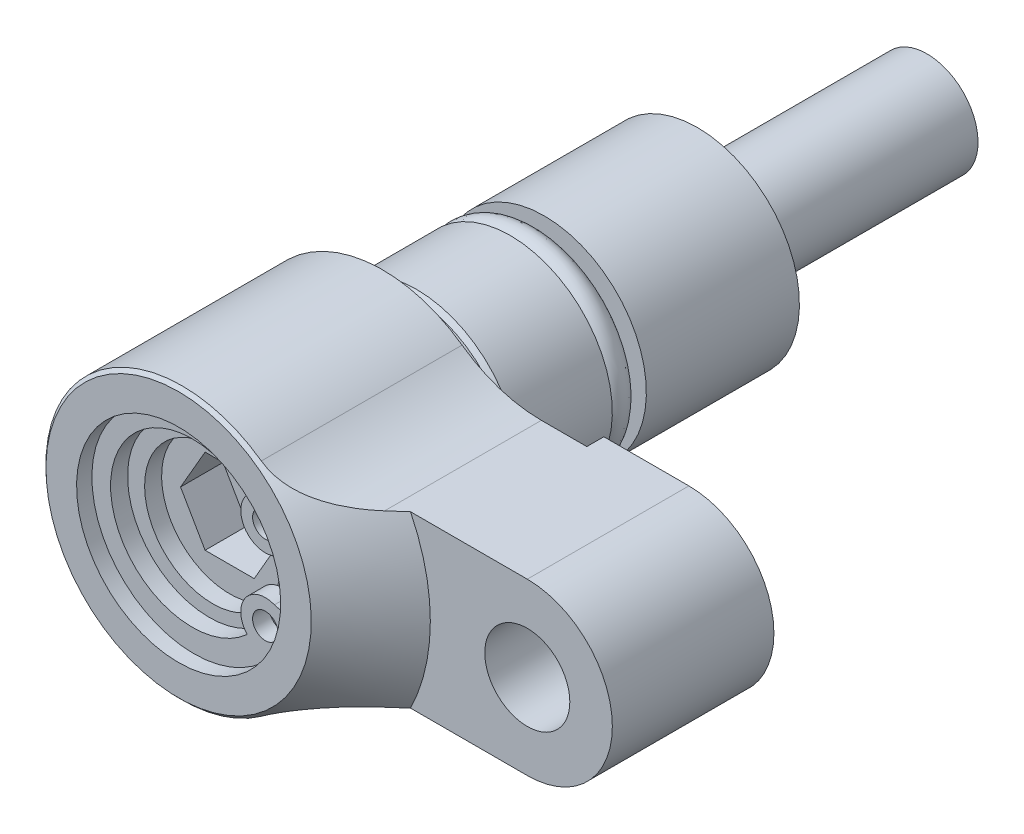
ISO-10303-21;
HEADER;
FILE_DESCRIPTION(('STEP AP214'),'2;1');
FILE_NAME('part.step','',(''),(''),'','','');
FILE_SCHEMA(('AUTOMOTIVE_DESIGN { 1 0 10303 214 1 1 1 1 }'));
ENDSEC;
DATA;
#1=APPLICATION_CONTEXT('core data for automotive mechanical design processes');
#2=APPLICATION_PROTOCOL_DEFINITION('international standard','automotive_design',2000,#1);
#3=PRODUCT_CONTEXT('',#1,'mechanical');
#4=PRODUCT('Part','Part','',(#3));
#5=PRODUCT_RELATED_PRODUCT_CATEGORY('part','',(#4));
#6=PRODUCT_DEFINITION_FORMATION('','',#4);
#7=PRODUCT_DEFINITION_CONTEXT('part definition',#1,'design');
#8=PRODUCT_DEFINITION('design','',#6,#7);
#9=PRODUCT_DEFINITION_SHAPE('','',#8);
#10=(LENGTH_UNIT() NAMED_UNIT(*) SI_UNIT(.MILLI.,.METRE.));
#11=(NAMED_UNIT(*) PLANE_ANGLE_UNIT() SI_UNIT($,.RADIAN.));
#12=(NAMED_UNIT(*) SI_UNIT($,.STERADIAN.) SOLID_ANGLE_UNIT());
#13=UNCERTAINTY_MEASURE_WITH_UNIT(LENGTH_MEASURE(1.E-05),#10,'distance_accuracy_value','');
#14=(GEOMETRIC_REPRESENTATION_CONTEXT(3) GLOBAL_UNCERTAINTY_ASSIGNED_CONTEXT((#13)) GLOBAL_UNIT_ASSIGNED_CONTEXT((#10,
#11,#12)) REPRESENTATION_CONTEXT('',''));
#15=CARTESIAN_POINT('',(0.,0.,0.));
#16=DIRECTION('',(0.,0.,1.));
#17=DIRECTION('',(1.,0.,0.));
#18=AXIS2_PLACEMENT_3D('',#15,#16,#17);
#19=CARTESIAN_POINT('',(6.072,6.072,-6.5));
#20=DIRECTION('',(0.,0.,-1.));
#21=DIRECTION('',(0.,-1.,0.));
#22=AXIS2_PLACEMENT_3D('',#19,#20,#21);
#23=PLANE('',#22);
#24=CARTESIAN_POINT('',(0.,0.,-6.5));
#25=DIRECTION('',(0.,0.,-1.));
#26=DIRECTION('',(0.,1.,0.));
#27=AXIS2_PLACEMENT_3D('',#24,#25,#26);
#28=CIRCLE('',#27,6.);
#29=CARTESIAN_POINT('',(0.,6.,-6.5));
#30=VERTEX_POINT('',#29);
#31=EDGE_CURVE('E266',#30,#30,#28,.T.);
#32=ORIENTED_EDGE('',*,*,#31,.T.);
#33=EDGE_LOOP('',(#32));
#34=FACE_BOUND('',#33,.T.);
#35=CARTESIAN_POINT('',(0.,0.,-6.5));
#36=DIRECTION('',(0.,0.,1.));
#37=DIRECTION('',(0.,-1.,0.));
#38=AXIS2_PLACEMENT_3D('',#35,#36,#37);
#39=CIRCLE('',#38,5.375);
#40=CARTESIAN_POINT('',(0.,-5.375,-6.5));
#41=VERTEX_POINT('',#40);
#42=EDGE_CURVE('E405',#41,#41,#39,.T.);
#43=ORIENTED_EDGE('',*,*,#42,.T.);
#44=EDGE_LOOP('',(#43));
#45=FACE_BOUND('',#44,.T.);
#46=ADVANCED_FACE('F14',(#34,#45),#23,.T.);
#47=CARTESIAN_POINT('',(0.,0.,11.));
#48=DIRECTION('',(0.,0.,-1.));
#49=DIRECTION('',(0.,1.,0.));
#50=AXIS2_PLACEMENT_3D('',#47,#48,#49);
#51=CYLINDRICAL_SURFACE('',#50,4.);
#52=CARTESIAN_POINT('',(0.,0.,11.));
#53=DIRECTION('',(0.,0.,-1.));
#54=DIRECTION('',(0.,1.,0.));
#55=AXIS2_PLACEMENT_3D('',#52,#53,#54);
#56=CIRCLE('',#55,4.);
#57=CARTESIAN_POINT('',(3.82683149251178,-1.16419960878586,11.));
#58=VERTEX_POINT('',#57);
#59=CARTESIAN_POINT('',(2.70178181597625,-2.94963981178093,11.));
#60=VERTEX_POINT('',#59);
#61=EDGE_CURVE('E206',#58,#60,#56,.T.);
#62=ORIENTED_EDGE('',*,*,#61,.F.);
#63=CARTESIAN_POINT('',(0.,0.,11.));
#64=DIRECTION('',(0.,0.,-1.));
#65=DIRECTION('',(0.,1.,0.));
#66=AXIS2_PLACEMENT_3D('',#63,#64,#65);
#67=CIRCLE('',#66,4.);
#68=CARTESIAN_POINT('',(3.82683149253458,1.16419960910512,11.));
#69=VERTEX_POINT('',#68);
#70=EDGE_CURVE('E214',#69,#58,#67,.T.);
#71=ORIENTED_EDGE('',*,*,#70,.F.);
#72=CARTESIAN_POINT('',(0.,0.,11.));
#73=DIRECTION('',(0.,0.,-1.));
#74=DIRECTION('',(0.,1.,0.));
#75=AXIS2_PLACEMENT_3D('',#72,#73,#74);
#76=CIRCLE('',#75,4.);
#77=CARTESIAN_POINT('',(2.7017818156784,2.94963981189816,11.));
#78=VERTEX_POINT('',#77);
#79=EDGE_CURVE('E216',#78,#69,#76,.T.);
#80=ORIENTED_EDGE('',*,*,#79,.F.);
#81=CARTESIAN_POINT('',(0.,0.,11.));
#82=DIRECTION('',(0.,0.,-1.));
#83=DIRECTION('',(0.,1.,0.));
#84=AXIS2_PLACEMENT_3D('',#81,#82,#83);
#85=CIRCLE('',#84,4.);
#86=EDGE_CURVE('E203',#60,#78,#85,.T.);
#87=ORIENTED_EDGE('',*,*,#86,.F.);
#88=EDGE_LOOP('',(#62,#71,#80,#87));
#89=FACE_BOUND('',#88,.T.);
#90=CARTESIAN_POINT('',(0.,0.,10.));
#91=DIRECTION('',(0.,0.,-1.));
#92=DIRECTION('',(0.,1.,0.));
#93=AXIS2_PLACEMENT_3D('',#90,#91,#92);
#94=CIRCLE('',#93,4.);
#95=CARTESIAN_POINT('',(0.,4.,10.));
#96=VERTEX_POINT('',#95);
#97=EDGE_CURVE('E18',#96,#96,#94,.T.);
#98=ORIENTED_EDGE('',*,*,#97,.T.);
#99=EDGE_LOOP('',(#98));
#100=FACE_BOUND('',#99,.T.);
#101=ADVANCED_FACE('F485',(#89,#100),#51,.F.);
#102=CARTESIAN_POINT('',(0.,0.,-1.));
#103=DIRECTION('',(0.,0.,-1.));
#104=DIRECTION('',(0.,1.,0.));
#105=AXIS2_PLACEMENT_3D('',#102,#103,#104);
#106=CYLINDRICAL_SURFACE('',#105,6.);
#107=CARTESIAN_POINT('',(0.,0.,-1.00000000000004));
#108=DIRECTION('',(0.,0.,-1.));
#109=DIRECTION('',(0.,-1.,0.));
#110=AXIS2_PLACEMENT_3D('',#107,#108,#109);
#111=CIRCLE('',#110,6.);
#112=CARTESIAN_POINT('',(0.,-6.,-1.));
#113=VERTEX_POINT('',#112);
#114=EDGE_CURVE('E262',#113,#113,#111,.T.);
#115=ORIENTED_EDGE('',*,*,#114,.T.);
#116=EDGE_LOOP('',(#115));
#117=FACE_BOUND('',#116,.T.);
#118=ORIENTED_EDGE('',*,*,#31,.F.);
#119=EDGE_LOOP('',(#118));
#120=FACE_BOUND('',#119,.T.);
#121=ADVANCED_FACE('F446',(#117,#120),#106,.T.);
#122=CARTESIAN_POINT('',(0.,0.,-0.75));
#123=DIRECTION('',(0.,0.,-1.));
#124=DIRECTION('',(0.,1.,0.));
#125=AXIS2_PLACEMENT_3D('',#122,#123,#124);
#126=CONICAL_SURFACE('',#125,5.75,0.785398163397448);
#127=CARTESIAN_POINT('',(0.,0.,-0.75));
#128=DIRECTION('',(0.,0.,-1.));
#129=DIRECTION('',(0.,-1.,0.));
#130=AXIS2_PLACEMENT_3D('',#127,#128,#129);
#131=CIRCLE('',#130,5.75);
#132=CARTESIAN_POINT('',(0.,-5.75,-0.75));
#133=VERTEX_POINT('',#132);
#134=EDGE_CURVE('E267',#133,#133,#131,.T.);
#135=ORIENTED_EDGE('',*,*,#134,.T.);
#136=EDGE_LOOP('',(#135));
#137=FACE_BOUND('',#136,.T.);
#138=ORIENTED_EDGE('',*,*,#114,.F.);
#139=EDGE_LOOP('',(#138));
#140=FACE_BOUND('',#139,.T.);
#141=ADVANCED_FACE('F484',(#137,#140),#126,.T.);
#142=CARTESIAN_POINT('',(22.06,-5.,0.));
#143=DIRECTION('',(0.,0.,1.));
#144=DIRECTION('',(0.,1.,0.));
#145=AXIS2_PLACEMENT_3D('',#142,#143,#144);
#146=PLANE('',#145);
#147=CARTESIAN_POINT('',(17.,0.,0.));
#148=DIRECTION('',(0.,0.,1.));
#149=DIRECTION('',(1.,0.,0.));
#150=AXIS2_PLACEMENT_3D('',#147,#148,#149);
#151=CIRCLE('',#150,2.5);
#152=CARTESIAN_POINT('',(19.5,0.,0.));
#153=VERTEX_POINT('',#152);
#154=EDGE_CURVE('E422',#153,#153,#151,.T.);
#155=ORIENTED_EDGE('',*,*,#154,.T.);
#156=EDGE_LOOP('',(#155));
#157=FACE_BOUND('',#156,.T.);
#158=DIRECTION('',(0.,1.,0.));
#159=VECTOR('',#158,1.);
#160=CARTESIAN_POINT('',(12.,0.,0.));
#161=LINE('',#160,#159);
#162=CARTESIAN_POINT('',(12.0000000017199,-5.,0.));
#163=VERTEX_POINT('',#162);
#164=CARTESIAN_POINT('',(12.0000000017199,5.,0.));
#165=VERTEX_POINT('',#164);
#166=EDGE_CURVE('E271',#163,#165,#161,.T.);
#167=ORIENTED_EDGE('',*,*,#166,.T.);
#168=DIRECTION('',(1.,0.,0.));
#169=VECTOR('',#168,1.);
#170=CARTESIAN_POINT('',(13.1636895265,5.,0.));
#171=LINE('',#170,#169);
#172=CARTESIAN_POINT('',(17.0000000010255,5.,0.));
#173=VERTEX_POINT('',#172);
#174=EDGE_CURVE('E137',#165,#173,#171,.T.);
#175=ORIENTED_EDGE('',*,*,#174,.T.);
#176=CARTESIAN_POINT('',(17.,0.,0.));
#177=DIRECTION('',(0.,0.,-1.));
#178=DIRECTION('',(1.,0.,0.));
#179=AXIS2_PLACEMENT_3D('',#176,#177,#178);
#180=CIRCLE('',#179,5.);
#181=CARTESIAN_POINT('',(17.,-5.,0.));
#182=VERTEX_POINT('',#181);
#183=EDGE_CURVE('E136',#173,#182,#180,.T.);
#184=ORIENTED_EDGE('',*,*,#183,.T.);
#185=DIRECTION('',(-1.,0.,0.));
#186=VECTOR('',#185,1.);
#187=CARTESIAN_POINT('',(13.1636895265,-5.,0.));
#188=LINE('',#187,#186);
#189=EDGE_CURVE('E283',#182,#163,#188,.T.);
#190=ORIENTED_EDGE('',*,*,#189,.T.);
#191=EDGE_LOOP('',(#167,#175,#184,#190));
#192=FACE_BOUND('',#191,.T.);
#193=ADVANCED_FACE('F495',(#157,#192),#146,.F.);
#194=CARTESIAN_POINT('',(12.,-5.,0.));
#195=DIRECTION('',(1.,0.,0.));
#196=DIRECTION('',(0.,1.,0.));
#197=AXIS2_PLACEMENT_3D('',#194,#195,#196);
#198=PLANE('',#197);
#199=DIRECTION('',(0.,0.,1.));
#200=VECTOR('',#199,1.);
#201=CARTESIAN_POINT('',(12.0000000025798,-5.,5.139148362));
#202=LINE('',#201,#200);
#203=CARTESIAN_POINT('',(12.0000000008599,-4.999999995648,1.));
#204=VERTEX_POINT('',#203);
#205=EDGE_CURVE('E286',#163,#204,#202,.T.);
#206=ORIENTED_EDGE('',*,*,#205,.T.);
#207=DIRECTION('',(0.,-1.,0.));
#208=VECTOR('',#207,1.);
#209=CARTESIAN_POINT('',(12.,0.,1.));
#210=LINE('',#209,#208);
#211=CARTESIAN_POINT('',(12.0000000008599,4.999999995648,1.00000000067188));
#212=VERTEX_POINT('',#211);
#213=EDGE_CURVE('E294',#212,#204,#210,.T.);
#214=ORIENTED_EDGE('',*,*,#213,.F.);
#215=DIRECTION('',(0.,0.,-1.));
#216=VECTOR('',#215,1.);
#217=CARTESIAN_POINT('',(12.0000000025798,5.,5.139148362));
#218=LINE('',#217,#216);
#219=EDGE_CURVE('E276',#212,#165,#218,.T.);
#220=ORIENTED_EDGE('',*,*,#219,.T.);
#221=ORIENTED_EDGE('',*,*,#166,.F.);
#222=EDGE_LOOP('',(#206,#214,#220,#221));
#223=FACE_BOUND('',#222,.T.);
#224=ADVANCED_FACE('F499',(#223),#198,.F.);
#225=CARTESIAN_POINT('',(0.,0.,1.));
#226=DIRECTION('',(0.,0.,-1.));
#227=DIRECTION('',(1.,0.,0.));
#228=AXIS2_PLACEMENT_3D('',#225,#226,#227);
#229=CYLINDRICAL_SURFACE('',#228,5.75);
#230=CARTESIAN_POINT('',(0.,0.,1.));
#231=DIRECTION('',(0.,0.,-1.));
#232=DIRECTION('',(1.,0.,0.));
#233=AXIS2_PLACEMENT_3D('',#230,#231,#232);
#234=CIRCLE('',#233,5.75);
#235=CARTESIAN_POINT('',(5.75,0.,1.));
#236=VERTEX_POINT('',#235);
#237=EDGE_CURVE('E349',#236,#236,#234,.F.);
#238=ORIENTED_EDGE('',*,*,#237,.F.);
#239=EDGE_LOOP('',(#238));
#240=FACE_BOUND('',#239,.T.);
#241=ORIENTED_EDGE('',*,*,#134,.F.);
#242=EDGE_LOOP('',(#241));
#243=FACE_BOUND('',#242,.T.);
#244=ADVANCED_FACE('F497',(#240,#243),#229,.T.);
#245=CARTESIAN_POINT('',(9.327379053,5.,0.));
#246=DIRECTION('',(0.,-1.,0.));
#247=DIRECTION('',(1.,0.,0.));
#248=AXIS2_PLACEMENT_3D('',#245,#246,#247);
#249=PLANE('',#248);
#250=DIRECTION('',(1.,0.,0.));
#251=VECTOR('',#250,1.);
#252=CARTESIAN_POINT('',(16.066803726,5.,9.5));
#253=LINE('',#252,#251);
#254=CARTESIAN_POINT('',(10.1336074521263,5.,9.50000000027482));
#255=VERTEX_POINT('',#254);
#256=CARTESIAN_POINT('',(17.0000000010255,5.,9.5));
#257=VERTEX_POINT('',#256);
#258=EDGE_CURVE('E341',#255,#257,#253,.T.);
#259=ORIENTED_EDGE('',*,*,#258,.T.);
#260=DIRECTION('',(0.,0.,1.));
#261=VECTOR('',#260,1.);
#262=CARTESIAN_POINT('',(17.0000000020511,5.,4.75));
#263=LINE('',#262,#261);
#264=EDGE_CURVE('E287',#257,#173,#263,.F.);
#265=ORIENTED_EDGE('',*,*,#264,.T.);
#266=ORIENTED_EDGE('',*,*,#174,.F.);
#267=ORIENTED_EDGE('',*,*,#219,.F.);
#268=DIRECTION('',(1.,0.,0.));
#269=VECTOR('',#268,1.);
#270=CARTESIAN_POINT('',(1.94,4.999999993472,1.));
#271=LINE('',#270,#269);
#272=CARTESIAN_POINT('',(9.327379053,4.999999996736,1.));
#273=VERTEX_POINT('',#272);
#274=EDGE_CURVE('E144',#273,#212,#271,.T.);
#275=ORIENTED_EDGE('',*,*,#274,.F.);
#276=DIRECTION('',(0.,0.,1.));
#277=VECTOR('',#276,1.);
#278=CARTESIAN_POINT('',(9.327379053,5.,6.9354));
#279=LINE('',#278,#277);
#280=CARTESIAN_POINT('',(9.32737905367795,5.,10.2169947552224));
#281=VERTEX_POINT('',#280);
#282=EDGE_CURVE('E140',#281,#273,#279,.F.);
#283=ORIENTED_EDGE('',*,*,#282,.F.);
#284=CARTESIAN_POINT('',(10.1336074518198,5.,9.50000000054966));
#285=CARTESIAN_POINT('',(9.9997501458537,5.,9.62007716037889));
#286=CARTESIAN_POINT('',(9.86563580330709,5.,9.7398652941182));
#287=CARTESIAN_POINT('',(9.59689300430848,5.,9.97886354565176));
#288=CARTESIAN_POINT('',(9.4622645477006,5.,10.0980736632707));
#289=CARTESIAN_POINT('',(9.32737905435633,5.,10.2169947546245));
#290=B_SPLINE_CURVE_WITH_KNOTS('',3,(#284,#285,#286,#287,#288,#289),.UNSPECIFIED.,.F.,.F.,(4,2,
4),(0.,0.539465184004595,1.07893053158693),.UNSPECIFIED.);
#291=EDGE_CURVE('E125',#255,#281,#290,.T.);
#292=ORIENTED_EDGE('',*,*,#291,.F.);
#293=EDGE_LOOP('',(#259,#265,#266,#267,#275,#283,#292));
#294=FACE_BOUND('',#293,.T.);
#295=ADVANCED_FACE('F141',(#294),#249,.F.);
#296=CARTESIAN_POINT('',(17.,0.,9.5));
#297=DIRECTION('',(0.,0.,-1.));
#298=DIRECTION('',(1.,0.,0.));
#299=AXIS2_PLACEMENT_3D('',#296,#297,#298);
#300=CYLINDRICAL_SURFACE('',#299,5.);
#301=CARTESIAN_POINT('',(17.,0.,9.5));
#302=DIRECTION('',(0.,0.,-1.));
#303=DIRECTION('',(1.,0.,0.));
#304=AXIS2_PLACEMENT_3D('',#301,#302,#303);
#305=CIRCLE('',#304,5.);
#306=CARTESIAN_POINT('',(17.,-5.,9.5));
#307=VERTEX_POINT('',#306);
#308=EDGE_CURVE('E314',#257,#307,#305,.T.);
#309=ORIENTED_EDGE('',*,*,#308,.T.);
#310=DIRECTION('',(0.,0.,-1.));
#311=VECTOR('',#310,1.);
#312=CARTESIAN_POINT('',(17.,-5.,5.139148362));
#313=LINE('',#312,#311);
#314=EDGE_CURVE('E303',#307,#182,#313,.T.);
#315=ORIENTED_EDGE('',*,*,#314,.T.);
#316=ORIENTED_EDGE('',*,*,#183,.F.);
#317=ORIENTED_EDGE('',*,*,#264,.F.);
#318=EDGE_LOOP('',(#309,#315,#316,#317));
#319=FACE_BOUND('',#318,.T.);
#320=ADVANCED_FACE('F177',(#319),#300,.T.);
#321=CARTESIAN_POINT('',(17.,-5.,0.));
#322=DIRECTION('',(0.,1.,0.));
#323=DIRECTION('',(-1.,0.,0.));
#324=AXIS2_PLACEMENT_3D('',#321,#322,#323);
#325=PLANE('',#324);
#326=DIRECTION('',(-1.,0.,0.));
#327=VECTOR('',#326,1.);
#328=CARTESIAN_POINT('',(16.066803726,-5.,9.5));
#329=LINE('',#328,#327);
#330=CARTESIAN_POINT('',(10.1336074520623,-5.,9.50000000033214));
#331=VERTEX_POINT('',#330);
#332=EDGE_CURVE('E338',#307,#331,#329,.T.);
#333=ORIENTED_EDGE('',*,*,#332,.T.);
#334=CARTESIAN_POINT('',(9.3273790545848,-5.00000000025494,10.2169947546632));
#335=CARTESIAN_POINT('',(9.46226454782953,-5.00000000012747,10.0980736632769));
#336=CARTESIAN_POINT('',(9.59689300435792,-5.00000000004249,9.97886354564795));
#337=CARTESIAN_POINT('',(9.86563580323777,-4.99999999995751,9.73986529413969));
#338=CARTESIAN_POINT('',(9.99975014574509,-4.99999999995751,9.62007716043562));
#339=CARTESIAN_POINT('',(10.133607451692,-5.,9.50000000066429));
#340=B_SPLINE_CURVE_WITH_KNOTS('',3,(#334,#335,#336,#337,#338,#339),.UNSPECIFIED.,.F.,.F.,(4,2,
4),(0.,0.539465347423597,1.07893053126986),.UNSPECIFIED.);
#341=CARTESIAN_POINT('',(9.32737905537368,-5.,10.2169947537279));
#342=VERTEX_POINT('',#341);
#343=EDGE_CURVE('E302',#342,#331,#340,.T.);
#344=ORIENTED_EDGE('',*,*,#343,.F.);
#345=DIRECTION('',(0.,0.,-1.));
#346=VECTOR('',#345,1.);
#347=CARTESIAN_POINT('',(9.32737905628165,-5.,6.9354));
#348=LINE('',#347,#346);
#349=CARTESIAN_POINT('',(9.32737905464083,-4.999999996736,1.));
#350=VERTEX_POINT('',#349);
#351=EDGE_CURVE('E310',#350,#342,#348,.F.);
#352=ORIENTED_EDGE('',*,*,#351,.F.);
#353=DIRECTION('',(-1.,0.,0.));
#354=VECTOR('',#353,1.);
#355=CARTESIAN_POINT('',(1.94,-4.999999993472,1.));
#356=LINE('',#355,#354);
#357=EDGE_CURVE('E297',#204,#350,#356,.T.);
#358=ORIENTED_EDGE('',*,*,#357,.F.);
#359=ORIENTED_EDGE('',*,*,#205,.F.);
#360=ORIENTED_EDGE('',*,*,#189,.F.);
#361=ORIENTED_EDGE('',*,*,#314,.F.);
#362=EDGE_LOOP('',(#333,#344,#352,#358,#359,#360,#361));
#363=FACE_BOUND('',#362,.T.);
#364=ADVANCED_FACE('F537',(#363),#325,.F.);
#365=CARTESIAN_POINT('',(12.,8.096,1.));
#366=DIRECTION('',(0.,0.,-1.));
#367=DIRECTION('',(0.,-1.,0.));
#368=AXIS2_PLACEMENT_3D('',#365,#366,#367);
#369=PLANE('',#368);
#370=ORIENTED_EDGE('',*,*,#237,.T.);
#371=EDGE_LOOP('',(#370));
#372=FACE_BOUND('',#371,.T.);
#373=CARTESIAN_POINT('',(0.,0.,1.));
#374=DIRECTION('',(0.,0.,-1.));
#375=DIRECTION('',(0.,1.,0.));
#376=AXIS2_PLACEMENT_3D('',#373,#374,#375);
#377=CIRCLE('',#376,8.);
#378=CARTESIAN_POINT('',(4.6636895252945,-6.50000000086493,1.));
#379=VERTEX_POINT('',#378);
#380=CARTESIAN_POINT('',(4.66368952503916,6.50000000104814,1.));
#381=VERTEX_POINT('',#380);
#382=EDGE_CURVE('E154',#379,#381,#377,.T.);
#383=ORIENTED_EDGE('',*,*,#382,.T.);
#384=CARTESIAN_POINT('',(9.327379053,13.,1.));
#385=DIRECTION('',(0.,0.,-1.));
#386=DIRECTION('',(1.,0.,0.));
#387=AXIS2_PLACEMENT_3D('',#384,#385,#386);
#388=CIRCLE('',#387,8.);
#389=EDGE_CURVE('E148',#273,#381,#388,.T.);
#390=ORIENTED_EDGE('',*,*,#389,.F.);
#391=ORIENTED_EDGE('',*,*,#274,.T.);
#392=ORIENTED_EDGE('',*,*,#213,.T.);
#393=ORIENTED_EDGE('',*,*,#357,.T.);
#394=CARTESIAN_POINT('',(9.327379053,-13.,1.));
#395=DIRECTION('',(0.,0.,-1.));
#396=DIRECTION('',(1.,0.,0.));
#397=AXIS2_PLACEMENT_3D('',#394,#395,#396);
#398=CIRCLE('',#397,8.);
#399=EDGE_CURVE('E313',#379,#350,#398,.T.);
#400=ORIENTED_EDGE('',*,*,#399,.F.);
#401=EDGE_LOOP('',(#383,#390,#391,#392,#393,#400));
#402=FACE_BOUND('',#401,.T.);
#403=ADVANCED_FACE('F176',(#372,#402),#369,.T.);
#404=CARTESIAN_POINT('',(9.327379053,13.,12.8708));
#405=DIRECTION('',(0.,0.,-1.));
#406=DIRECTION('',(1.,0.,0.));
#407=AXIS2_PLACEMENT_3D('',#404,#405,#406);
#408=CYLINDRICAL_SURFACE('',#407,8.);
#409=ORIENTED_EDGE('',*,*,#282,.T.);
#410=ORIENTED_EDGE('',*,*,#389,.T.);
#411=DIRECTION('',(0.,0.,-1.));
#412=VECTOR('',#411,1.);
#413=CARTESIAN_POINT('',(4.66368952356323,6.50000000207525,6.9354));
#414=LINE('',#413,#412);
#415=CARTESIAN_POINT('',(4.66368952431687,6.50000000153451,12.8000000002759));
#416=VERTEX_POINT('',#415);
#417=EDGE_CURVE('E149',#381,#416,#414,.F.);
#418=ORIENTED_EDGE('',*,*,#417,.T.);
#419=CARTESIAN_POINT('',(4.66368952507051,6.50000000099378,12.8000000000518));
#420=CARTESIAN_POINT('',(4.76444696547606,6.42766670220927,12.8000899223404));
#421=CARTESIAN_POINT('',(4.86687472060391,6.35776488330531,12.7942339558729));
#422=CARTESIAN_POINT('',(5.07375407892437,6.22344414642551,12.7713368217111));
#423=CARTESIAN_POINT('',(5.17820101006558,6.15901408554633,12.7543190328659));
#424=CARTESIAN_POINT('',(5.3861943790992,6.03714460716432,12.7102313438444));
#425=CARTESIAN_POINT('',(5.48971897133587,5.97959381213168,12.6833628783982));
#426=CARTESIAN_POINT('',(5.69706808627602,5.87016207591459,12.6205971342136));
#427=CARTESIAN_POINT('',(5.80089274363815,5.81828430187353,12.584694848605));
#428=CARTESIAN_POINT('',(6.03910704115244,5.7055200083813,12.4931193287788));
#429=CARTESIAN_POINT('',(6.17337077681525,5.64656578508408,12.4347433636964));
#430=CARTESIAN_POINT('',(6.44038825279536,5.53768819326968,12.3071887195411));
#431=CARTESIAN_POINT('',(6.57314144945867,5.48776798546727,12.2380062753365));
#432=CARTESIAN_POINT('',(6.83841044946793,5.39572474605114,12.0900472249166));
#433=CARTESIAN_POINT('',(6.97090066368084,5.35371168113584,12.0111574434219));
#434=CARTESIAN_POINT('',(7.23376158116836,5.27759784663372,11.8463181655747));
#435=CARTESIAN_POINT('',(7.36413155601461,5.24349974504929,11.7603663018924));
#436=CARTESIAN_POINT('',(7.65441654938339,5.17513186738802,11.5611197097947));
#437=CARTESIAN_POINT('',(7.81374370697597,5.14286722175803,11.4462856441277));
#438=CARTESIAN_POINT('',(8.12928677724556,5.08860293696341,11.210029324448));
#439=CARTESIAN_POINT('',(8.28550124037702,5.06660797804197,11.0886040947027));
#440=CARTESIAN_POINT('',(8.59089130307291,5.03252941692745,10.8440321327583));
#441=CARTESIAN_POINT('',(8.74014397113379,5.02020034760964,10.7210146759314));
#442=CARTESIAN_POINT('',(9.03580290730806,5.00395253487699,10.4714394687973));
#443=CARTESIAN_POINT('',(9.18221262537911,5.00002287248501,10.344886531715));
#444=CARTESIAN_POINT('',(9.32737905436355,5.,10.2169947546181));
#445=B_SPLINE_CURVE_WITH_KNOTS('',3,(#419,#420,#421,#422,#423,#424,#425,#426,#427,#428,#429,
#430,#431,#432,#433,#434,#435,#436,#437,#438,#439,#440,#441,#442,#443,#444),.UNSPECIFIED.,.F.,
.F.,(4,2,2,2,2,2,2,2,2,2,2,2,4),(0.,0.371830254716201,0.74288417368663,1.10673899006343,
1.47079591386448,1.94350692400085,2.41638300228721,2.89541514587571,3.37460852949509,
3.97121739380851,4.56809788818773,5.14927959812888,5.72970532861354),.UNSPECIFIED.);
#446=EDGE_CURVE('E133',#416,#281,#445,.T.);
#447=ORIENTED_EDGE('',*,*,#446,.T.);
#448=EDGE_LOOP('',(#409,#410,#418,#447));
#449=FACE_BOUND('',#448,.T.);
#450=ADVANCED_FACE('F152',(#449),#408,.F.);
#451=CARTESIAN_POINT('',(22.071198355,5.,9.5));
#452=DIRECTION('',(0.,0.,-1.));
#453=DIRECTION('',(0.,-1.,0.));
#454=AXIS2_PLACEMENT_3D('',#451,#452,#453);
#455=PLANE('',#454);
#456=CARTESIAN_POINT('',(17.,0.,9.5));
#457=DIRECTION('',(0.,0.,1.));
#458=DIRECTION('',(1.,0.,0.));
#459=AXIS2_PLACEMENT_3D('',#456,#457,#458);
#460=CIRCLE('',#459,2.5);
#461=CARTESIAN_POINT('',(19.5,0.,9.5));
#462=VERTEX_POINT('',#461);
#463=EDGE_CURVE('E1054',#462,#462,#460,.T.);
#464=ORIENTED_EDGE('',*,*,#463,.F.);
#465=EDGE_LOOP('',(#464));
#466=FACE_BOUND('',#465,.T.);
#467=ORIENTED_EDGE('',*,*,#258,.F.);
#468=CARTESIAN_POINT('',(0.,0.,9.5));
#469=DIRECTION('',(0.,0.,-1.));
#470=DIRECTION('',(0.,1.,0.));
#471=AXIS2_PLACEMENT_3D('',#468,#469,#470);
#472=CIRCLE('',#471,11.3);
#473=EDGE_CURVE('E135',#255,#331,#472,.T.);
#474=ORIENTED_EDGE('',*,*,#473,.T.);
#475=ORIENTED_EDGE('',*,*,#332,.F.);
#476=ORIENTED_EDGE('',*,*,#308,.F.);
#477=EDGE_LOOP('',(#467,#474,#475,#476));
#478=FACE_BOUND('',#477,.T.);
#479=ADVANCED_FACE('F175',(#466,#478),#455,.F.);
#480=CARTESIAN_POINT('',(9.327379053,-13.,12.8708));
#481=DIRECTION('',(0.,0.,-1.));
#482=DIRECTION('',(1.,0.,0.));
#483=AXIS2_PLACEMENT_3D('',#480,#481,#482);
#484=CYLINDRICAL_SURFACE('',#483,8.);
#485=DIRECTION('',(0.,0.,1.));
#486=VECTOR('',#485,1.);
#487=CARTESIAN_POINT('',(4.6636895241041,-6.5000000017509,6.9));
#488=LINE('',#487,#486);
#489=CARTESIAN_POINT('',(4.66368952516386,-6.50000000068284,12.80000000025));
#490=VERTEX_POINT('',#489);
#491=EDGE_CURVE('E158',#490,#379,#488,.F.);
#492=ORIENTED_EDGE('',*,*,#491,.T.);
#493=ORIENTED_EDGE('',*,*,#399,.T.);
#494=ORIENTED_EDGE('',*,*,#351,.T.);
#495=CARTESIAN_POINT('',(9.3273790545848,-5.00000000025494,10.2169947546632));
#496=CARTESIAN_POINT('',(9.23094196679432,-5.00000345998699,10.3019835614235));
#497=CARTESIAN_POINT('',(9.13396162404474,-5.00174343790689,10.3863469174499));
#498=CARTESIAN_POINT('',(8.93883324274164,-5.00884385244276,10.5536005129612));
#499=CARTESIAN_POINT('',(8.8406849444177,-5.01420510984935,10.636490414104));
#500=CARTESIAN_POINT('',(8.54347258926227,-5.03601130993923,10.8833560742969));
#501=CARTESIAN_POINT('',(8.34257724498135,-5.05818168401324,11.044696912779));
#502=CARTESIAN_POINT('',(7.92864249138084,-5.12035200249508,11.3627233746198));
#503=CARTESIAN_POINT('',(7.71542249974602,-5.16093338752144,11.5190633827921));
#504=CARTESIAN_POINT('',(7.28332151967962,-5.26236730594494,11.8160106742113));
#505=CARTESIAN_POINT('',(7.06445449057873,-5.32317358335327,11.9566528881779));
#506=CARTESIAN_POINT('',(6.73868939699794,-5.42962165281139,12.1465315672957));
#507=CARTESIAN_POINT('',(6.63399833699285,-5.466191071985,12.2046726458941));
#508=CARTESIAN_POINT('',(6.42351281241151,-5.54478539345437,12.3149233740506));
#509=CARTESIAN_POINT('',(6.31771823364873,-5.58681086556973,12.3670323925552));
#510=CARTESIAN_POINT('',(6.00143558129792,-5.72058634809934,12.5114673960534));
#511=CARTESIAN_POINT('',(5.78941447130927,-5.82087615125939,12.5934856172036));
#512=CARTESIAN_POINT('',(5.50119157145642,-5.97376744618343,12.679539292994));
#513=CARTESIAN_POINT('',(5.42425613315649,-6.01620007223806,12.7000181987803));
#514=CARTESIAN_POINT('',(5.27089307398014,-6.10415201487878,12.7355408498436));
#515=CARTESIAN_POINT('',(5.19446532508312,-6.14967051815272,12.7505860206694));
#516=CARTESIAN_POINT('',(5.04149221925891,-6.24430881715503,12.7750384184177));
#517=CARTESIAN_POINT('',(4.9649591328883,-6.29346884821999,12.784367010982));
#518=CARTESIAN_POINT('',(4.81320872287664,-6.39465128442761,12.7968640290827));
#519=CARTESIAN_POINT('',(4.73799250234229,-6.44667595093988,12.8000275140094));
#520=CARTESIAN_POINT('',(4.66368952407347,-6.50000000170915,12.8000000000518));
#521=B_SPLINE_CURVE_WITH_KNOTS('',3,(#495,#496,#497,#498,#499,#500,#501,#502,#503,#504,#505,
#506,#507,#508,#509,#510,#511,#512,#513,#514,#515,#516,#517,#518,#519,#520),.UNSPECIFIED.,.F.,
.F.,(4,2,2,2,2,2,2,2,2,2,2,2,4),(0.,0.385597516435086,0.771282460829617,1.5464004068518,
2.34791340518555,3.14760573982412,3.52298989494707,3.89841328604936,4.63977154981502,
4.91025952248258,5.18067648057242,5.45473422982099,5.7290115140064),.UNSPECIFIED.);
#522=EDGE_CURVE('E156',#342,#490,#521,.T.);
#523=ORIENTED_EDGE('',*,*,#522,.T.);
#524=EDGE_LOOP('',(#492,#493,#494,#523));
#525=FACE_BOUND('',#524,.T.);
#526=ADVANCED_FACE('F179',(#525),#484,.F.);
#527=CARTESIAN_POINT('',(0.,0.,12.8));
#528=DIRECTION('',(0.,0.,-1.));
#529=DIRECTION('',(0.,1.,0.));
#530=AXIS2_PLACEMENT_3D('',#527,#528,#529);
#531=CYLINDRICAL_SURFACE('',#530,8.);
#532=CARTESIAN_POINT('',(0.,0.,12.8));
#533=DIRECTION('',(0.,0.,-1.));
#534=DIRECTION('',(0.,-1.,0.));
#535=AXIS2_PLACEMENT_3D('',#532,#533,#534);
#536=CIRCLE('',#535,8.);
#537=EDGE_CURVE('E190',#490,#416,#536,.T.);
#538=ORIENTED_EDGE('',*,*,#537,.T.);
#539=ORIENTED_EDGE('',*,*,#417,.F.);
#540=ORIENTED_EDGE('',*,*,#382,.F.);
#541=ORIENTED_EDGE('',*,*,#491,.F.);
#542=EDGE_LOOP('',(#538,#539,#540,#541));
#543=FACE_BOUND('',#542,.T.);
#544=ADVANCED_FACE('F182',(#543),#531,.T.);
#545=CARTESIAN_POINT('',(0.,0.,13.));
#546=DIRECTION('',(0.,0.,-1.));
#547=DIRECTION('',(0.,1.,0.));
#548=AXIS2_PLACEMENT_3D('',#545,#546,#547);
#549=CONICAL_SURFACE('',#548,7.8,0.785398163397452);
#550=ORIENTED_EDGE('',*,*,#537,.F.);
#551=ORIENTED_EDGE('',*,*,#522,.F.);
#552=ORIENTED_EDGE('',*,*,#343,.T.);
#553=ORIENTED_EDGE('',*,*,#473,.F.);
#554=ORIENTED_EDGE('',*,*,#291,.T.);
#555=ORIENTED_EDGE('',*,*,#446,.F.);
#556=EDGE_LOOP('',(#550,#551,#552,#553,#554,#555));
#557=FACE_BOUND('',#556,.T.);
#558=CARTESIAN_POINT('',(0.,0.,13.));
#559=DIRECTION('',(0.,0.,-1.));
#560=DIRECTION('',(0.,1.,0.));
#561=AXIS2_PLACEMENT_3D('',#558,#559,#560);
#562=CIRCLE('',#561,7.8);
#563=CARTESIAN_POINT('',(0.,7.8,13.));
#564=VERTEX_POINT('',#563);
#565=EDGE_CURVE('E191',#564,#564,#562,.F.);
#566=ORIENTED_EDGE('',*,*,#565,.F.);
#567=EDGE_LOOP('',(#566));
#568=FACE_BOUND('',#567,.T.);
#569=ADVANCED_FACE('F130',(#557,#568),#549,.T.);
#570=CARTESIAN_POINT('',(7.8936,-7.8936,13.));
#571=DIRECTION('',(0.,0.,1.));
#572=DIRECTION('',(0.,1.,0.));
#573=AXIS2_PLACEMENT_3D('',#570,#571,#572);
#574=PLANE('',#573);
#575=CARTESIAN_POINT('',(0.,0.,13.));
#576=DIRECTION('',(0.,0.,1.));
#577=DIRECTION('',(0.,-1.,0.));
#578=AXIS2_PLACEMENT_3D('',#575,#576,#577);
#579=CIRCLE('',#578,6.);
#580=CARTESIAN_POINT('',(0.,-6.,13.));
#581=VERTEX_POINT('',#580);
#582=EDGE_CURVE('E194',#581,#581,#579,.T.);
#583=ORIENTED_EDGE('',*,*,#582,.F.);
#584=EDGE_LOOP('',(#583));
#585=FACE_BOUND('',#584,.T.);
#586=ORIENTED_EDGE('',*,*,#565,.T.);
#587=EDGE_LOOP('',(#586));
#588=FACE_BOUND('',#587,.T.);
#589=ADVANCED_FACE('F638',(#585,#588),#574,.T.);
#590=CARTESIAN_POINT('',(0.,0.,12.1));
#591=DIRECTION('',(0.,0.,1.));
#592=DIRECTION('',(0.,-1.,0.));
#593=AXIS2_PLACEMENT_3D('',#590,#591,#592);
#594=CYLINDRICAL_SURFACE('',#593,6.);
#595=ORIENTED_EDGE('',*,*,#582,.T.);
#596=EDGE_LOOP('',(#595));
#597=FACE_BOUND('',#596,.T.);
#598=CARTESIAN_POINT('',(0.,0.,12.1));
#599=DIRECTION('',(0.,0.,1.));
#600=DIRECTION('',(0.,-1.,0.));
#601=AXIS2_PLACEMENT_3D('',#598,#599,#600);
#602=CIRCLE('',#601,6.);
#603=CARTESIAN_POINT('',(0.,-6.,12.1));
#604=VERTEX_POINT('',#603);
#605=EDGE_CURVE('E209',#604,#604,#602,.T.);
#606=ORIENTED_EDGE('',*,*,#605,.F.);
#607=EDGE_LOOP('',(#606));
#608=FACE_BOUND('',#607,.T.);
#609=ADVANCED_FACE('F641',(#597,#608),#594,.F.);
#610=CARTESIAN_POINT('',(-5.048170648,-4.8576,11.));
#611=DIRECTION('',(0.,0.,1.));
#612=DIRECTION('',(1.,0.,0.));
#613=AXIS2_PLACEMENT_3D('',#610,#611,#612);
#614=PLANE('',#613);
#615=CARTESIAN_POINT('',(4.098067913,-2.582293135,11.));
#616=DIRECTION('',(0.,0.,-1.));
#617=DIRECTION('',(0.,1.,0.));
#618=AXIS2_PLACEMENT_3D('',#615,#616,#617);
#619=CIRCLE('',#618,1.443800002);
#620=CARTESIAN_POINT('',(3.02844140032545,-3.55206505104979,11.));
#621=VERTEX_POINT('',#620);
#622=EDGE_CURVE('E200',#621,#60,#619,.T.);
#623=ORIENTED_EDGE('',*,*,#622,.T.);
#624=ORIENTED_EDGE('',*,*,#86,.T.);
#625=CARTESIAN_POINT('',(4.098067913,2.582293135,11.));
#626=DIRECTION('',(0.,0.,-1.));
#627=DIRECTION('',(0.,1.,0.));
#628=AXIS2_PLACEMENT_3D('',#625,#626,#627);
#629=CIRCLE('',#628,1.443800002);
#630=CARTESIAN_POINT('',(3.02844140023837,3.55206505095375,11.));
#631=VERTEX_POINT('',#630);
#632=EDGE_CURVE('E197',#78,#631,#629,.T.);
#633=ORIENTED_EDGE('',*,*,#632,.T.);
#634=CARTESIAN_POINT('',(-0.2,0.,11.));
#635=DIRECTION('',(0.,0.,-1.));
#636=DIRECTION('',(0.,1.,0.));
#637=AXIS2_PLACEMENT_3D('',#634,#635,#636);
#638=CIRCLE('',#637,4.8);
#639=EDGE_CURVE('E219',#621,#631,#638,.T.);
#640=ORIENTED_EDGE('',*,*,#639,.F.);
#641=EDGE_LOOP('',(#623,#624,#633,#640));
#642=FACE_BOUND('',#641,.T.);
#643=ADVANCED_FACE('F643',(#642),#614,.T.);
#644=CARTESIAN_POINT('',(3.833866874,-2.960352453,11.));
#645=DIRECTION('',(0.,0.,-1.));
#646=DIRECTION('',(-1.,0.,0.));
#647=AXIS2_PLACEMENT_3D('',#644,#645,#646);
#648=PLANE('',#647);
#649=ORIENTED_EDGE('',*,*,#61,.T.);
#650=CARTESIAN_POINT('',(4.098067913,-2.582293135,11.));
#651=DIRECTION('',(0.,0.,-1.));
#652=DIRECTION('',(0.,1.,0.));
#653=AXIS2_PLACEMENT_3D('',#650,#651,#652);
#654=CIRCLE('',#653,1.443800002);
#655=EDGE_CURVE('E222',#60,#58,#654,.T.);
#656=ORIENTED_EDGE('',*,*,#655,.T.);
#657=EDGE_LOOP('',(#649,#656));
#658=FACE_BOUND('',#657,.T.);
#659=ADVANCED_FACE('F646',(#658),#648,.T.);
#660=CARTESIAN_POINT('',(6.578,-6.578,12.1));
#661=DIRECTION('',(0.,0.,-1.));
#662=DIRECTION('',(-1.,0.,0.));
#663=AXIS2_PLACEMENT_3D('',#660,#661,#662);
#664=PLANE('',#663);
#665=ORIENTED_EDGE('',*,*,#605,.T.);
#666=EDGE_LOOP('',(#665));
#667=FACE_BOUND('',#666,.T.);
#668=CARTESIAN_POINT('',(0.,0.,12.1));
#669=DIRECTION('',(0.,0.,1.));
#670=DIRECTION('',(0.,-1.,0.));
#671=AXIS2_PLACEMENT_3D('',#668,#669,#670);
#672=CIRCLE('',#671,6.5);
#673=CARTESIAN_POINT('',(0.,-6.5,12.1));
#674=VERTEX_POINT('',#673);
#675=EDGE_CURVE('E229',#674,#674,#672,.T.);
#676=ORIENTED_EDGE('',*,*,#675,.F.);
#677=EDGE_LOOP('',(#676));
#678=FACE_BOUND('',#677,.T.);
#679=ADVANCED_FACE('F650',(#667,#678),#664,.T.);
#680=CARTESIAN_POINT('',(3.813792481,-1.571499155,11.));
#681=DIRECTION('',(0.,0.,1.));
#682=DIRECTION('',(1.,0.,0.));
#683=AXIS2_PLACEMENT_3D('',#680,#681,#682);
#684=PLANE('',#683);
#685=ORIENTED_EDGE('',*,*,#70,.T.);
#686=CARTESIAN_POINT('',(4.098067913,-2.582293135,11.));
#687=DIRECTION('',(0.,0.,-1.));
#688=DIRECTION('',(0.,1.,0.));
#689=AXIS2_PLACEMENT_3D('',#686,#687,#688);
#690=CIRCLE('',#689,1.443800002);
#691=CARTESIAN_POINT('',(4.63423307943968,-1.24173901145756,11.));
#692=VERTEX_POINT('',#691);
#693=EDGE_CURVE('E225',#58,#692,#690,.T.);
#694=ORIENTED_EDGE('',*,*,#693,.T.);
#695=DIRECTION('',(0.965925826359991,-0.258819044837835,0.));
#696=VECTOR('',#695,1.);
#697=CARTESIAN_POINT('',(5.4563754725,-1.4620314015,11.));
#698=LINE('',#697,#696);
#699=CARTESIAN_POINT('',(6.27851787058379,-1.68232379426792,11.0000000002));
#700=VERTEX_POINT('',#699);
#701=EDGE_CURVE('E320',#692,#700,#698,.T.);
#702=ORIENTED_EDGE('',*,*,#701,.T.);
#703=CARTESIAN_POINT('',(0.,0.,11.));
#704=DIRECTION('',(0.,0.,1.));
#705=DIRECTION('',(0.,-1.,0.));
#706=AXIS2_PLACEMENT_3D('',#703,#704,#705);
#707=CIRCLE('',#706,6.5);
#708=CARTESIAN_POINT('',(6.28074866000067,1.67397618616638,11.0000000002));
#709=VERTEX_POINT('',#708);
#710=EDGE_CURVE('E350',#700,#709,#707,.T.);
#711=ORIENTED_EDGE('',*,*,#710,.T.);
#712=DIRECTION('',(-0.965925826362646,-0.258819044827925,0.));
#713=VECTOR('',#712,1.);
#714=CARTESIAN_POINT('',(5.407977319,1.440117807,11.));
#715=LINE('',#714,#713);
#716=CARTESIAN_POINT('',(4.53520599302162,1.20625943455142,11.));
#717=VERTEX_POINT('',#716);
#718=EDGE_CURVE('E323',#709,#717,#715,.T.);
#719=ORIENTED_EDGE('',*,*,#718,.T.);
#720=CARTESIAN_POINT('',(4.098067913,2.582293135,11.));
#721=DIRECTION('',(0.,0.,-1.));
#722=DIRECTION('',(0.,1.,0.));
#723=AXIS2_PLACEMENT_3D('',#720,#721,#722);
#724=CIRCLE('',#723,1.443800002);
#725=EDGE_CURVE('E212',#717,#69,#724,.T.);
#726=ORIENTED_EDGE('',*,*,#725,.T.);
#727=EDGE_LOOP('',(#685,#694,#702,#711,#719,#726));
#728=FACE_BOUND('',#727,.T.);
#729=ADVANCED_FACE('F654',(#728),#684,.T.);
#730=CARTESIAN_POINT('',(3.833866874,1.153486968,11.));
#731=DIRECTION('',(0.,0.,-1.));
#732=DIRECTION('',(-1.,0.,0.));
#733=AXIS2_PLACEMENT_3D('',#730,#731,#732);
#734=PLANE('',#733);
#735=ORIENTED_EDGE('',*,*,#79,.T.);
#736=CARTESIAN_POINT('',(4.098067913,2.582293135,11.));
#737=DIRECTION('',(0.,0.,-1.));
#738=DIRECTION('',(0.,1.,0.));
#739=AXIS2_PLACEMENT_3D('',#736,#737,#738);
#740=CIRCLE('',#739,1.443800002);
#741=EDGE_CURVE('E234',#69,#78,#740,.T.);
#742=ORIENTED_EDGE('',*,*,#741,.T.);
#743=EDGE_LOOP('',(#735,#742));
#744=FACE_BOUND('',#743,.T.);
#745=ADVANCED_FACE('F658',(#744),#734,.T.);
#746=CARTESIAN_POINT('',(3.339067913,1.823293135,11.));
#747=DIRECTION('',(0.,0.,1.));
#748=DIRECTION('',(1.,0.,0.));
#749=AXIS2_PLACEMENT_3D('',#746,#747,#748);
#750=PLANE('',#749);
#751=CARTESIAN_POINT('',(4.098067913,2.582293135,11.));
#752=DIRECTION('',(0.,0.,-1.));
#753=DIRECTION('',(0.,1.,0.));
#754=AXIS2_PLACEMENT_3D('',#751,#752,#753);
#755=CIRCLE('',#754,0.75);
#756=CARTESIAN_POINT('',(4.098067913,3.332293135,11.));
#757=VERTEX_POINT('',#756);
#758=EDGE_CURVE('E238',#757,#757,#755,.T.);
#759=ORIENTED_EDGE('',*,*,#758,.F.);
#760=EDGE_LOOP('',(#759));
#761=FACE_BOUND('',#760,.T.);
#762=ADVANCED_FACE('F662',(#761),#750,.T.);
#763=CARTESIAN_POINT('',(-0.2,0.,12.));
#764=DIRECTION('',(0.,0.,-1.));
#765=DIRECTION('',(0.,1.,0.));
#766=AXIS2_PLACEMENT_3D('',#763,#764,#765);
#767=CYLINDRICAL_SURFACE('',#766,4.8);
#768=DIRECTION('',(0.,0.,1.));
#769=VECTOR('',#768,1.);
#770=CARTESIAN_POINT('',(3.02844140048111,-3.55206505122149,11.5));
#771=LINE('',#770,#769);
#772=CARTESIAN_POINT('',(3.02844140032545,-3.55206505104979,12.));
#773=VERTEX_POINT('',#772);
#774=EDGE_CURVE('E221',#773,#621,#771,.F.);
#775=ORIENTED_EDGE('',*,*,#774,.T.);
#776=ORIENTED_EDGE('',*,*,#639,.T.);
#777=DIRECTION('',(0.,0.,-1.));
#778=VECTOR('',#777,1.);
#779=CARTESIAN_POINT('',(3.02844140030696,3.55206505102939,11.5));
#780=LINE('',#779,#778);
#781=CARTESIAN_POINT('',(3.02844140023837,3.55206505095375,12.));
#782=VERTEX_POINT('',#781);
#783=EDGE_CURVE('E236',#631,#782,#780,.F.);
#784=ORIENTED_EDGE('',*,*,#783,.T.);
#785=CARTESIAN_POINT('',(-0.2,0.,12.));
#786=DIRECTION('',(0.,0.,-1.));
#787=DIRECTION('',(0.,1.,0.));
#788=AXIS2_PLACEMENT_3D('',#785,#786,#787);
#789=CIRCLE('',#788,4.8);
#790=EDGE_CURVE('E241',#782,#773,#789,.F.);
#791=ORIENTED_EDGE('',*,*,#790,.T.);
#792=EDGE_LOOP('',(#775,#776,#784,#791));
#793=FACE_BOUND('',#792,.T.);
#794=ADVANCED_FACE('F666',(#793),#767,.F.);
#795=CARTESIAN_POINT('',(4.098067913,-2.582293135,12.));
#796=DIRECTION('',(0.,0.,-1.));
#797=DIRECTION('',(0.,1.,0.));
#798=AXIS2_PLACEMENT_3D('',#795,#796,#797);
#799=CYLINDRICAL_SURFACE('',#798,1.443800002);
#800=CARTESIAN_POINT('',(4.098067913,-2.582293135,12.));
#801=DIRECTION('',(0.,0.,-1.));
#802=DIRECTION('',(0.,1.,0.));
#803=AXIS2_PLACEMENT_3D('',#800,#801,#802);
#804=CIRCLE('',#803,1.443800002);
#805=CARTESIAN_POINT('',(4.63423307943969,-1.24173901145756,12.));
#806=VERTEX_POINT('',#805);
#807=EDGE_CURVE('E244',#773,#806,#804,.T.);
#808=ORIENTED_EDGE('',*,*,#807,.T.);
#809=DIRECTION('',(0.,0.,-1.));
#810=VECTOR('',#809,1.);
#811=CARTESIAN_POINT('',(4.634233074,-1.24173901,11.5));
#812=LINE('',#811,#810);
#813=EDGE_CURVE('E228',#806,#692,#812,.T.);
#814=ORIENTED_EDGE('',*,*,#813,.T.);
#815=ORIENTED_EDGE('',*,*,#693,.F.);
#816=ORIENTED_EDGE('',*,*,#655,.F.);
#817=ORIENTED_EDGE('',*,*,#622,.F.);
#818=ORIENTED_EDGE('',*,*,#774,.F.);
#819=EDGE_LOOP('',(#808,#814,#815,#816,#817,#818));
#820=FACE_BOUND('',#819,.T.);
#821=ADVANCED_FACE('F672',(#820),#799,.T.);
#822=CARTESIAN_POINT('',(4.634233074,-1.24173901,11.));
#823=DIRECTION('',(-0.258819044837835,-0.965925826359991,0.));
#824=DIRECTION('',(0.965925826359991,-0.258819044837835,0.));
#825=AXIS2_PLACEMENT_3D('',#822,#823,#824);
#826=PLANE('',#825);
#827=ORIENTED_EDGE('',*,*,#701,.F.);
#828=ORIENTED_EDGE('',*,*,#813,.F.);
#829=DIRECTION('',(0.965925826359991,-0.258819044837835,0.));
#830=VECTOR('',#829,1.);
#831=CARTESIAN_POINT('',(4.634233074,-1.24173901,12.));
#832=LINE('',#831,#830);
#833=CARTESIAN_POINT('',(6.27851787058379,-1.68232379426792,12.0000000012));
#834=VERTEX_POINT('',#833);
#835=EDGE_CURVE('E247',#806,#834,#832,.T.);
#836=ORIENTED_EDGE('',*,*,#835,.T.);
#837=DIRECTION('',(0.,0.,-1.));
#838=VECTOR('',#837,1.);
#839=CARTESIAN_POINT('',(6.27851787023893,-1.68232379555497,10.8));
#840=LINE('',#839,#838);
#841=EDGE_CURVE('E233',#700,#834,#840,.F.);
#842=ORIENTED_EDGE('',*,*,#841,.F.);
#843=EDGE_LOOP('',(#827,#828,#836,#842));
#844=FACE_BOUND('',#843,.T.);
#845=ADVANCED_FACE('F668',(#844),#826,.F.);
#846=CARTESIAN_POINT('',(0.,0.,9.5));
#847=DIRECTION('',(0.,0.,1.));
#848=DIRECTION('',(0.,-1.,0.));
#849=AXIS2_PLACEMENT_3D('',#846,#847,#848);
#850=CYLINDRICAL_SURFACE('',#849,6.5);
#851=ORIENTED_EDGE('',*,*,#710,.F.);
#852=ORIENTED_EDGE('',*,*,#841,.T.);
#853=CARTESIAN_POINT('',(0.,0.,12.0000000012));
#854=DIRECTION('',(0.,0.,1.));
#855=DIRECTION('',(0.,-1.,0.));
#856=AXIS2_PLACEMENT_3D('',#853,#854,#855);
#857=CIRCLE('',#856,6.5);
#858=CARTESIAN_POINT('',(6.28074866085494,1.67397618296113,12.0000000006));
#859=VERTEX_POINT('',#858);
#860=EDGE_CURVE('E250',#834,#859,#857,.F.);
#861=ORIENTED_EDGE('',*,*,#860,.T.);
#862=DIRECTION('',(0.,0.,-1.));
#863=VECTOR('',#862,1.);
#864=CARTESIAN_POINT('',(6.280748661,1.673976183,11.5));
#865=LINE('',#864,#863);
#866=EDGE_CURVE('E232',#859,#709,#865,.T.);
#867=ORIENTED_EDGE('',*,*,#866,.T.);
#868=EDGE_LOOP('',(#851,#852,#861,#867));
#869=FACE_BOUND('',#868,.T.);
#870=ORIENTED_EDGE('',*,*,#675,.T.);
#871=EDGE_LOOP('',(#870));
#872=FACE_BOUND('',#871,.T.);
#873=ADVANCED_FACE('F671',(#869,#872),#850,.F.);
#874=CARTESIAN_POINT('',(6.280748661,1.673976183,11.));
#875=DIRECTION('',(-0.258819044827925,0.965925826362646,0.));
#876=DIRECTION('',(-0.965925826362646,-0.258819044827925,0.));
#877=AXIS2_PLACEMENT_3D('',#874,#875,#876);
#878=PLANE('',#877);
#879=ORIENTED_EDGE('',*,*,#718,.F.);
#880=ORIENTED_EDGE('',*,*,#866,.F.);
#881=DIRECTION('',(-0.965925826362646,-0.258819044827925,0.));
#882=VECTOR('',#881,1.);
#883=CARTESIAN_POINT('',(6.280748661,1.673976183,12.));
#884=LINE('',#883,#882);
#885=CARTESIAN_POINT('',(4.5352059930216,1.20625943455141,12.));
#886=VERTEX_POINT('',#885);
#887=EDGE_CURVE('E253',#859,#886,#884,.T.);
#888=ORIENTED_EDGE('',*,*,#887,.T.);
#889=DIRECTION('',(0.,0.,1.));
#890=VECTOR('',#889,1.);
#891=CARTESIAN_POINT('',(4.53520597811,1.2062594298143,11.5));
#892=LINE('',#891,#890);
#893=EDGE_CURVE('E237',#886,#717,#892,.F.);
#894=ORIENTED_EDGE('',*,*,#893,.T.);
#895=EDGE_LOOP('',(#879,#880,#888,#894));
#896=FACE_BOUND('',#895,.T.);
#897=ADVANCED_FACE('F674',(#896),#878,.F.);
#898=CARTESIAN_POINT('',(4.098067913,2.582293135,12.));
#899=DIRECTION('',(0.,0.,-1.));
#900=DIRECTION('',(0.,1.,0.));
#901=AXIS2_PLACEMENT_3D('',#898,#899,#900);
#902=CYLINDRICAL_SURFACE('',#901,1.443800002);
#903=CARTESIAN_POINT('',(4.098067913,2.582293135,12.));
#904=DIRECTION('',(0.,0.,-1.));
#905=DIRECTION('',(0.,1.,0.));
#906=AXIS2_PLACEMENT_3D('',#903,#904,#905);
#907=CIRCLE('',#906,1.443800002);
#908=EDGE_CURVE('E33',#886,#782,#907,.T.);
#909=ORIENTED_EDGE('',*,*,#908,.T.);
#910=ORIENTED_EDGE('',*,*,#783,.F.);
#911=ORIENTED_EDGE('',*,*,#632,.F.);
#912=ORIENTED_EDGE('',*,*,#741,.F.);
#913=ORIENTED_EDGE('',*,*,#725,.F.);
#914=ORIENTED_EDGE('',*,*,#893,.F.);
#915=EDGE_LOOP('',(#909,#910,#911,#912,#913,#914));
#916=FACE_BOUND('',#915,.T.);
#917=ADVANCED_FACE('F676',(#916),#902,.T.);
#918=CARTESIAN_POINT('',(4.098067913,2.582293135,12.));
#919=DIRECTION('',(0.,0.,-1.));
#920=DIRECTION('',(0.,1.,0.));
#921=AXIS2_PLACEMENT_3D('',#918,#919,#920);
#922=CYLINDRICAL_SURFACE('',#921,0.75);
#923=ORIENTED_EDGE('',*,*,#758,.T.);
#924=EDGE_LOOP('',(#923));
#925=FACE_BOUND('',#924,.T.);
#926=CARTESIAN_POINT('',(4.098067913,2.582293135,12.));
#927=DIRECTION('',(0.,0.,-1.));
#928=DIRECTION('',(0.,1.,0.));
#929=AXIS2_PLACEMENT_3D('',#926,#927,#928);
#930=CIRCLE('',#929,0.75);
#931=CARTESIAN_POINT('',(4.098067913,3.332293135,12.));
#932=VERTEX_POINT('',#931);
#933=EDGE_CURVE('E257',#932,#932,#930,.F.);
#934=ORIENTED_EDGE('',*,*,#933,.T.);
#935=EDGE_LOOP('',(#934));
#936=FACE_BOUND('',#935,.T.);
#937=ADVANCED_FACE('F680',(#925,#936),#922,.F.);
#938=CARTESIAN_POINT('',(6.357433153,-6.578,12.));
#939=DIRECTION('',(0.,0.,-1.));
#940=DIRECTION('',(-1.,0.,0.));
#941=AXIS2_PLACEMENT_3D('',#938,#939,#940);
#942=PLANE('',#941);
#943=ORIENTED_EDGE('',*,*,#933,.F.);
#944=EDGE_LOOP('',(#943));
#945=FACE_BOUND('',#944,.T.);
#946=CARTESIAN_POINT('',(4.098067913,-2.582293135,12.));
#947=DIRECTION('',(0.,0.,-1.));
#948=DIRECTION('',(0.,1.,0.));
#949=AXIS2_PLACEMENT_3D('',#946,#947,#948);
#950=CIRCLE('',#949,0.75);
#951=CARTESIAN_POINT('',(4.098067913,-1.832293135,12.));
#952=VERTEX_POINT('',#951);
#953=EDGE_CURVE('E24',#952,#952,#950,.F.);
#954=ORIENTED_EDGE('',*,*,#953,.F.);
#955=EDGE_LOOP('',(#954));
#956=FACE_BOUND('',#955,.T.);
#957=ORIENTED_EDGE('',*,*,#908,.F.);
#958=ORIENTED_EDGE('',*,*,#887,.F.);
#959=ORIENTED_EDGE('',*,*,#860,.F.);
#960=ORIENTED_EDGE('',*,*,#835,.F.);
#961=ORIENTED_EDGE('',*,*,#807,.F.);
#962=ORIENTED_EDGE('',*,*,#790,.F.);
#963=EDGE_LOOP('',(#957,#958,#959,#960,#961,#962));
#964=FACE_BOUND('',#963,.T.);
#965=ADVANCED_FACE('F678',(#945,#956,#964),#942,.F.);
#966=CARTESIAN_POINT('',(3.339067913,-3.341293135,11.));
#967=DIRECTION('',(0.,0.,1.));
#968=DIRECTION('',(1.,0.,0.));
#969=AXIS2_PLACEMENT_3D('',#966,#967,#968);
#970=PLANE('',#969);
#971=CARTESIAN_POINT('',(4.098067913,-2.582293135,11.));
#972=DIRECTION('',(0.,0.,-1.));
#973=DIRECTION('',(0.,1.,0.));
#974=AXIS2_PLACEMENT_3D('',#971,#972,#973);
#975=CIRCLE('',#974,0.75);
#976=CARTESIAN_POINT('',(4.098067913,-1.832293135,11.));
#977=VERTEX_POINT('',#976);
#978=EDGE_CURVE('E9',#977,#977,#975,.T.);
#979=ORIENTED_EDGE('',*,*,#978,.F.);
#980=EDGE_LOOP('',(#979));
#981=FACE_BOUND('',#980,.T.);
#982=ADVANCED_FACE('F16',(#981),#970,.T.);
#983=CARTESIAN_POINT('',(4.098067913,-2.582293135,12.));
#984=DIRECTION('',(0.,0.,-1.));
#985=DIRECTION('',(0.,1.,0.));
#986=AXIS2_PLACEMENT_3D('',#983,#984,#985);
#987=CYLINDRICAL_SURFACE('',#986,0.75);
#988=ORIENTED_EDGE('',*,*,#953,.T.);
#989=EDGE_LOOP('',(#988));
#990=FACE_BOUND('',#989,.T.);
#991=ORIENTED_EDGE('',*,*,#978,.T.);
#992=EDGE_LOOP('',(#991));
#993=FACE_BOUND('',#992,.T.);
#994=ADVANCED_FACE('F444',(#990,#993),#987,.F.);
#995=CARTESIAN_POINT('',(-5.06,-5.06,10.));
#996=DIRECTION('',(0.,0.,-1.));
#997=DIRECTION('',(0.,1.,0.));
#998=AXIS2_PLACEMENT_3D('',#995,#996,#997);
#999=PLANE('',#998);
#1000=ORIENTED_EDGE('',*,*,#97,.F.);
#1001=EDGE_LOOP('',(#1000));
#1002=FACE_BOUND('',#1001,.T.);
#1003=DIRECTION('',(0.500000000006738,0.866025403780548,0.));
#1004=VECTOR('',#1003,1.);
#1005=CARTESIAN_POINT('',(1.443375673,-2.5,10.));
#1006=LINE('',#1005,#1004);
#1007=CARTESIAN_POINT('',(1.44337567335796,-2.49999999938,10.));
#1008=VERTEX_POINT('',#1007);
#1009=CARTESIAN_POINT('',(2.886751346,0.,10.));
#1010=VERTEX_POINT('',#1009);
#1011=EDGE_CURVE('E384',#1008,#1010,#1006,.T.);
#1012=ORIENTED_EDGE('',*,*,#1011,.F.);
#1013=DIRECTION('',(1.,0.,0.));
#1014=VECTOR('',#1013,1.);
#1015=CARTESIAN_POINT('',(0.,-2.49999999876,10.));
#1016=LINE('',#1015,#1014);
#1017=CARTESIAN_POINT('',(-1.44337567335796,-2.49999999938,10.));
#1018=VERTEX_POINT('',#1017);
#1019=EDGE_CURVE('E380',#1018,#1008,#1016,.T.);
#1020=ORIENTED_EDGE('',*,*,#1019,.F.);
#1021=DIRECTION('',(0.500000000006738,-0.866025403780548,0.));
#1022=VECTOR('',#1021,1.);
#1023=CARTESIAN_POINT('',(-2.886751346,0.,10.));
#1024=LINE('',#1023,#1022);
#1025=CARTESIAN_POINT('',(-2.886751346,0.,10.));
#1026=VERTEX_POINT('',#1025);
#1027=EDGE_CURVE('E383',#1026,#1018,#1024,.T.);
#1028=ORIENTED_EDGE('',*,*,#1027,.F.);
#1029=DIRECTION('',(-0.500000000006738,-0.866025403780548,0.));
#1030=VECTOR('',#1029,1.);
#1031=CARTESIAN_POINT('',(-1.443375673,2.5,10.));
#1032=LINE('',#1031,#1030);
#1033=CARTESIAN_POINT('',(-1.44337567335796,2.49999999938,10.));
#1034=VERTEX_POINT('',#1033);
#1035=EDGE_CURVE('E397',#1034,#1026,#1032,.T.);
#1036=ORIENTED_EDGE('',*,*,#1035,.F.);
#1037=DIRECTION('',(-1.,0.,0.));
#1038=VECTOR('',#1037,1.);
#1039=CARTESIAN_POINT('',(0.,2.49999999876,10.));
#1040=LINE('',#1039,#1038);
#1041=CARTESIAN_POINT('',(1.44337567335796,2.49999999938,10.));
#1042=VERTEX_POINT('',#1041);
#1043=EDGE_CURVE('E393',#1042,#1034,#1040,.T.);
#1044=ORIENTED_EDGE('',*,*,#1043,.F.);
#1045=DIRECTION('',(-0.500000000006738,0.866025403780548,0.));
#1046=VECTOR('',#1045,1.);
#1047=CARTESIAN_POINT('',(2.886751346,0.,10.));
#1048=LINE('',#1047,#1046);
#1049=EDGE_CURVE('E402',#1010,#1042,#1048,.T.);
#1050=ORIENTED_EDGE('',*,*,#1049,.F.);
#1051=EDGE_LOOP('',(#1012,#1020,#1028,#1036,#1044,#1050));
#1052=FACE_BOUND('',#1051,.T.);
#1053=ADVANCED_FACE('F440',(#1002,#1052),#999,.F.);
#1054=CARTESIAN_POINT('',(2.886751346,0.,7.5));
#1055=DIRECTION('',(0.866025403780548,0.500000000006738,0.));
#1056=DIRECTION('',(-0.500000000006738,0.866025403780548,0.));
#1057=AXIS2_PLACEMENT_3D('',#1054,#1055,#1056);
#1058=PLANE('',#1057);
#1059=DIRECTION('',(0.,0.,1.));
#1060=VECTOR('',#1059,1.);
#1061=CARTESIAN_POINT('',(1.443375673,2.5,8.75));
#1062=LINE('',#1061,#1060);
#1063=CARTESIAN_POINT('',(1.443375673,2.5,7.5));
#1064=VERTEX_POINT('',#1063);
#1065=EDGE_CURVE('E379',#1064,#1042,#1062,.T.);
#1066=ORIENTED_EDGE('',*,*,#1065,.F.);
#1067=DIRECTION('',(-0.500000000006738,0.866025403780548,0.));
#1068=VECTOR('',#1067,1.);
#1069=CARTESIAN_POINT('',(2.1650635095,1.25,7.5));
#1070=LINE('',#1069,#1068);
#1071=CARTESIAN_POINT('',(2.88675134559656,-6.98771308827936E-10,7.5));
#1072=VERTEX_POINT('',#1071);
#1073=EDGE_CURVE('E376',#1072,#1064,#1070,.T.);
#1074=ORIENTED_EDGE('',*,*,#1073,.F.);
#1075=DIRECTION('',(0.,0.,-1.));
#1076=VECTOR('',#1075,1.);
#1077=CARTESIAN_POINT('',(2.886751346,0.,8.75));
#1078=LINE('',#1077,#1076);
#1079=EDGE_CURVE('E375',#1010,#1072,#1078,.T.);
#1080=ORIENTED_EDGE('',*,*,#1079,.F.);
#1081=ORIENTED_EDGE('',*,*,#1049,.T.);
#1082=EDGE_LOOP('',(#1066,#1074,#1080,#1081));
#1083=FACE_BOUND('',#1082,.T.);
#1084=ADVANCED_FACE('F443',(#1083),#1058,.F.);
#1085=CARTESIAN_POINT('',(1.443375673,-2.5,7.5));
#1086=DIRECTION('',(0.866025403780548,-0.500000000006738,0.));
#1087=DIRECTION('',(0.500000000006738,0.866025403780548,0.));
#1088=AXIS2_PLACEMENT_3D('',#1085,#1086,#1087);
#1089=PLANE('',#1088);
#1090=ORIENTED_EDGE('',*,*,#1079,.T.);
#1091=DIRECTION('',(0.500000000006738,0.866025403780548,0.));
#1092=VECTOR('',#1091,1.);
#1093=CARTESIAN_POINT('',(2.1650635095,-1.25,7.5));
#1094=LINE('',#1093,#1092);
#1095=CARTESIAN_POINT('',(1.443375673,-2.5,7.5));
#1096=VERTEX_POINT('',#1095);
#1097=EDGE_CURVE('E372',#1096,#1072,#1094,.T.);
#1098=ORIENTED_EDGE('',*,*,#1097,.F.);
#1099=DIRECTION('',(0.,0.,-1.));
#1100=VECTOR('',#1099,1.);
#1101=CARTESIAN_POINT('',(1.443375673,-2.5,8.75));
#1102=LINE('',#1101,#1100);
#1103=EDGE_CURVE('E371',#1008,#1096,#1102,.T.);
#1104=ORIENTED_EDGE('',*,*,#1103,.F.);
#1105=ORIENTED_EDGE('',*,*,#1011,.T.);
#1106=EDGE_LOOP('',(#1090,#1098,#1104,#1105));
#1107=FACE_BOUND('',#1106,.T.);
#1108=ADVANCED_FACE('F449',(#1107),#1089,.F.);
#1109=CARTESIAN_POINT('',(-1.443375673,-2.5,7.5));
#1110=DIRECTION('',(0.,-1.,0.));
#1111=DIRECTION('',(1.,0.,0.));
#1112=AXIS2_PLACEMENT_3D('',#1109,#1110,#1111);
#1113=PLANE('',#1112);
#1114=ORIENTED_EDGE('',*,*,#1103,.T.);
#1115=DIRECTION('',(1.,0.,0.));
#1116=VECTOR('',#1115,1.);
#1117=CARTESIAN_POINT('',(0.,-2.5,7.5));
#1118=LINE('',#1117,#1116);
#1119=CARTESIAN_POINT('',(-1.443375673,-2.5,7.5));
#1120=VERTEX_POINT('',#1119);
#1121=EDGE_CURVE('E368',#1120,#1096,#1118,.T.);
#1122=ORIENTED_EDGE('',*,*,#1121,.F.);
#1123=DIRECTION('',(0.,0.,-1.));
#1124=VECTOR('',#1123,1.);
#1125=CARTESIAN_POINT('',(-1.443375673,-2.5,8.75));
#1126=LINE('',#1125,#1124);
#1127=EDGE_CURVE('E367',#1018,#1120,#1126,.T.);
#1128=ORIENTED_EDGE('',*,*,#1127,.F.);
#1129=ORIENTED_EDGE('',*,*,#1019,.T.);
#1130=EDGE_LOOP('',(#1114,#1122,#1128,#1129));
#1131=FACE_BOUND('',#1130,.T.);
#1132=ADVANCED_FACE('F453',(#1131),#1113,.F.);
#1133=CARTESIAN_POINT('',(-2.886751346,0.,7.5));
#1134=DIRECTION('',(-0.866025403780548,-0.500000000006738,0.));
#1135=DIRECTION('',(0.500000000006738,-0.866025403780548,0.));
#1136=AXIS2_PLACEMENT_3D('',#1133,#1134,#1135);
#1137=PLANE('',#1136);
#1138=ORIENTED_EDGE('',*,*,#1127,.T.);
#1139=DIRECTION('',(0.500000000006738,-0.866025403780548,0.));
#1140=VECTOR('',#1139,1.);
#1141=CARTESIAN_POINT('',(-2.1650635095,-1.25,7.5));
#1142=LINE('',#1141,#1140);
#1143=CARTESIAN_POINT('',(-2.88675134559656,6.98771254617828E-10,7.5));
#1144=VERTEX_POINT('',#1143);
#1145=EDGE_CURVE('E364',#1144,#1120,#1142,.T.);
#1146=ORIENTED_EDGE('',*,*,#1145,.F.);
#1147=DIRECTION('',(0.,0.,-1.));
#1148=VECTOR('',#1147,1.);
#1149=CARTESIAN_POINT('',(-2.886751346,0.,8.75));
#1150=LINE('',#1149,#1148);
#1151=EDGE_CURVE('E363',#1026,#1144,#1150,.T.);
#1152=ORIENTED_EDGE('',*,*,#1151,.F.);
#1153=ORIENTED_EDGE('',*,*,#1027,.T.);
#1154=EDGE_LOOP('',(#1138,#1146,#1152,#1153));
#1155=FACE_BOUND('',#1154,.T.);
#1156=ADVANCED_FACE('F457',(#1155),#1137,.F.);
#1157=CARTESIAN_POINT('',(-1.443375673,2.5,7.5));
#1158=DIRECTION('',(-0.866025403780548,0.500000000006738,0.));
#1159=DIRECTION('',(-0.500000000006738,-0.866025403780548,0.));
#1160=AXIS2_PLACEMENT_3D('',#1157,#1158,#1159);
#1161=PLANE('',#1160);
#1162=ORIENTED_EDGE('',*,*,#1151,.T.);
#1163=DIRECTION('',(-0.500000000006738,-0.866025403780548,0.));
#1164=VECTOR('',#1163,1.);
#1165=CARTESIAN_POINT('',(-2.1650635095,1.25,7.5));
#1166=LINE('',#1165,#1164);
#1167=CARTESIAN_POINT('',(-1.443375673,2.5,7.5));
#1168=VERTEX_POINT('',#1167);
#1169=EDGE_CURVE('E360',#1168,#1144,#1166,.T.);
#1170=ORIENTED_EDGE('',*,*,#1169,.F.);
#1171=DIRECTION('',(0.,0.,-1.));
#1172=VECTOR('',#1171,1.);
#1173=CARTESIAN_POINT('',(-1.443375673,2.5,8.75));
#1174=LINE('',#1173,#1172);
#1175=EDGE_CURVE('E359',#1034,#1168,#1174,.T.);
#1176=ORIENTED_EDGE('',*,*,#1175,.F.);
#1177=ORIENTED_EDGE('',*,*,#1035,.T.);
#1178=EDGE_LOOP('',(#1162,#1170,#1176,#1177));
#1179=FACE_BOUND('',#1178,.T.);
#1180=ADVANCED_FACE('F461',(#1179),#1161,.F.);
#1181=CARTESIAN_POINT('',(1.443375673,2.5,7.5));
#1182=DIRECTION('',(0.,1.,0.));
#1183=DIRECTION('',(-1.,0.,0.));
#1184=AXIS2_PLACEMENT_3D('',#1181,#1182,#1183);
#1185=PLANE('',#1184);
#1186=ORIENTED_EDGE('',*,*,#1175,.T.);
#1187=DIRECTION('',(-1.,0.,0.));
#1188=VECTOR('',#1187,1.);
#1189=CARTESIAN_POINT('',(0.,2.5,7.5));
#1190=LINE('',#1189,#1188);
#1191=EDGE_CURVE('E356',#1064,#1168,#1190,.T.);
#1192=ORIENTED_EDGE('',*,*,#1191,.F.);
#1193=ORIENTED_EDGE('',*,*,#1065,.T.);
#1194=ORIENTED_EDGE('',*,*,#1043,.T.);
#1195=EDGE_LOOP('',(#1186,#1192,#1193,#1194));
#1196=FACE_BOUND('',#1195,.T.);
#1197=ADVANCED_FACE('F465',(#1196),#1185,.F.);
#1198=CARTESIAN_POINT('',(-2.886751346,2.5,7.5));
#1199=DIRECTION('',(0.,0.,1.));
#1200=DIRECTION('',(0.,-1.,0.));
#1201=AXIS2_PLACEMENT_3D('',#1198,#1199,#1200);
#1202=PLANE('',#1201);
#1203=ORIENTED_EDGE('',*,*,#1145,.T.);
#1204=ORIENTED_EDGE('',*,*,#1121,.T.);
#1205=ORIENTED_EDGE('',*,*,#1097,.T.);
#1206=ORIENTED_EDGE('',*,*,#1073,.T.);
#1207=ORIENTED_EDGE('',*,*,#1191,.T.);
#1208=ORIENTED_EDGE('',*,*,#1169,.T.);
#1209=EDGE_LOOP('',(#1203,#1204,#1205,#1206,#1207,#1208));
#1210=FACE_BOUND('',#1209,.T.);
#1211=ADVANCED_FACE('F437',(#1210),#1202,.T.);
#1212=CARTESIAN_POINT('',(0.,-5.375,-6.5));
#1213=CARTESIAN_POINT('',(0.,-6.625,-6.5));
#1214=CARTESIAN_POINT('',(0.,-6.625,-8.));
#1215=CARTESIAN_POINT('',(0.,-5.375,-8.));
#1216=(BOUNDED_CURVE() B_SPLINE_CURVE(3,(#1212,#1213,#1214,#1215),.UNSPECIFIED.,.F.,
.F.) B_SPLINE_CURVE_WITH_KNOTS((4,4),(0.,1.),
.UNSPECIFIED.) CURVE() GEOMETRIC_REPRESENTATION_ITEM() RATIONAL_B_SPLINE_CURVE((1.,
0.333333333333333,0.333333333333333,1.)) REPRESENTATION_ITEM(''));
#1217=CARTESIAN_POINT('',(0.,0.,0.));
#1218=DIRECTION('',(0.,0.,1.));
#1219=AXIS1_PLACEMENT('',#1217,#1218);
#1220=SURFACE_OF_REVOLUTION('',#1216,#1219);
#1221=CARTESIAN_POINT('',(0.,0.,-8.));
#1222=DIRECTION('',(0.,0.,1.));
#1223=DIRECTION('',(0.,-1.,0.));
#1224=AXIS2_PLACEMENT_3D('',#1221,#1222,#1223);
#1225=CIRCLE('',#1224,5.375);
#1226=CARTESIAN_POINT('',(0.,-5.375,-8.));
#1227=VERTEX_POINT('',#1226);
#1228=EDGE_CURVE('E419',#1227,#1227,#1225,.T.);
#1229=ORIENTED_EDGE('',*,*,#1228,.T.);
#1230=EDGE_LOOP('',(#1229));
#1231=FACE_BOUND('',#1230,.T.);
#1232=ORIENTED_EDGE('',*,*,#42,.F.);
#1233=EDGE_LOOP('',(#1232));
#1234=FACE_BOUND('',#1233,.T.);
#1235=ADVANCED_FACE('F432',(#1231,#1234),#1220,.F.);
#1236=CARTESIAN_POINT('',(0.,-5.375,-8.));
#1237=DIRECTION('',(0.,0.,-1.));
#1238=DIRECTION('',(0.,1.,0.));
#1239=AXIS2_PLACEMENT_3D('',#1236,#1237,#1238);
#1240=PLANE('',#1239);
#1241=CARTESIAN_POINT('',(0.,0.,-8.));
#1242=DIRECTION('',(0.,0.,1.));
#1243=DIRECTION('',(0.,-1.,0.));
#1244=AXIS2_PLACEMENT_3D('',#1241,#1242,#1243);
#1245=CIRCLE('',#1244,4.75);
#1246=CARTESIAN_POINT('',(0.,-4.75,-8.));
#1247=VERTEX_POINT('',#1246);
#1248=EDGE_CURVE('E416',#1247,#1247,#1245,.T.);
#1249=ORIENTED_EDGE('',*,*,#1248,.T.);
#1250=EDGE_LOOP('',(#1249));
#1251=FACE_BOUND('',#1250,.T.);
#1252=ORIENTED_EDGE('',*,*,#1228,.F.);
#1253=EDGE_LOOP('',(#1252));
#1254=FACE_BOUND('',#1253,.T.);
#1255=ADVANCED_FACE('F436',(#1251,#1254),#1240,.T.);
#1256=CARTESIAN_POINT('',(-3.036,3.036,-31.));
#1257=DIRECTION('',(0.,0.,1.));
#1258=DIRECTION('',(0.,-1.,0.));
#1259=AXIS2_PLACEMENT_3D('',#1256,#1257,#1258);
#1260=PLANE('',#1259);
#1261=CARTESIAN_POINT('',(0.,0.,-31.));
#1262=DIRECTION('',(0.,0.,1.));
#1263=DIRECTION('',(0.,-1.,0.));
#1264=AXIS2_PLACEMENT_3D('',#1261,#1262,#1263);
#1265=CIRCLE('',#1264,3.);
#1266=CARTESIAN_POINT('',(0.,-3.,-31.));
#1267=VERTEX_POINT('',#1266);
#1268=EDGE_CURVE('E396',#1267,#1267,#1265,.F.);
#1269=ORIENTED_EDGE('',*,*,#1268,.T.);
#1270=EDGE_LOOP('',(#1269));
#1271=FACE_BOUND('',#1270,.T.);
#1272=ADVANCED_FACE('F470',(#1271),#1260,.F.);
#1273=CARTESIAN_POINT('',(0.,0.,-31.));
#1274=DIRECTION('',(0.,0.,1.));
#1275=DIRECTION('',(0.,-1.,0.));
#1276=AXIS2_PLACEMENT_3D('',#1273,#1274,#1275);
#1277=CYLINDRICAL_SURFACE('',#1276,3.);
#1278=CARTESIAN_POINT('',(0.,0.,-17.5));
#1279=DIRECTION('',(0.,0.,-1.));
#1280=DIRECTION('',(0.,1.,0.));
#1281=AXIS2_PLACEMENT_3D('',#1278,#1279,#1280);
#1282=CIRCLE('',#1281,3.);
#1283=CARTESIAN_POINT('',(0.,3.,-17.5));
#1284=VERTEX_POINT('',#1283);
#1285=EDGE_CURVE('E353',#1284,#1284,#1282,.F.);
#1286=ORIENTED_EDGE('',*,*,#1285,.F.);
#1287=EDGE_LOOP('',(#1286));
#1288=FACE_BOUND('',#1287,.T.);
#1289=ORIENTED_EDGE('',*,*,#1268,.F.);
#1290=EDGE_LOOP('',(#1289));
#1291=FACE_BOUND('',#1290,.T.);
#1292=ADVANCED_FACE('F473',(#1288,#1291),#1277,.T.);
#1293=CARTESIAN_POINT('',(6.072,6.072,-17.5));
#1294=DIRECTION('',(0.,0.,-1.));
#1295=DIRECTION('',(0.,-1.,0.));
#1296=AXIS2_PLACEMENT_3D('',#1293,#1294,#1295);
#1297=PLANE('',#1296);
#1298=CARTESIAN_POINT('',(0.,0.,-17.5));
#1299=DIRECTION('',(0.,0.,-1.));
#1300=DIRECTION('',(0.,1.,0.));
#1301=AXIS2_PLACEMENT_3D('',#1298,#1299,#1300);
#1302=CIRCLE('',#1301,6.);
#1303=CARTESIAN_POINT('',(0.,6.,-17.5));
#1304=VERTEX_POINT('',#1303);
#1305=EDGE_CURVE('E309',#1304,#1304,#1302,.T.);
#1306=ORIENTED_EDGE('',*,*,#1305,.T.);
#1307=EDGE_LOOP('',(#1306));
#1308=FACE_BOUND('',#1307,.T.);
#1309=ORIENTED_EDGE('',*,*,#1285,.T.);
#1310=EDGE_LOOP('',(#1309));
#1311=FACE_BOUND('',#1310,.T.);
#1312=ADVANCED_FACE('F480',(#1308,#1311),#1297,.T.);
#1313=CARTESIAN_POINT('',(0.,0.,-8.5));
#1314=DIRECTION('',(0.,0.,-1.));
#1315=DIRECTION('',(0.,1.,0.));
#1316=AXIS2_PLACEMENT_3D('',#1313,#1314,#1315);
#1317=CYLINDRICAL_SURFACE('',#1316,6.);
#1318=CARTESIAN_POINT('',(0.,0.,-8.5));
#1319=DIRECTION('',(0.,0.,-1.));
#1320=DIRECTION('',(0.,1.,0.));
#1321=AXIS2_PLACEMENT_3D('',#1318,#1319,#1320);
#1322=CIRCLE('',#1321,6.);
#1323=CARTESIAN_POINT('',(0.,6.,-8.5));
#1324=VERTEX_POINT('',#1323);
#1325=EDGE_CURVE('E270',#1324,#1324,#1322,.F.);
#1326=ORIENTED_EDGE('',*,*,#1325,.F.);
#1327=EDGE_LOOP('',(#1326));
#1328=FACE_BOUND('',#1327,.T.);
#1329=ORIENTED_EDGE('',*,*,#1305,.F.);
#1330=EDGE_LOOP('',(#1329));
#1331=FACE_BOUND('',#1330,.T.);
#1332=ADVANCED_FACE('F501',(#1328,#1331),#1317,.T.);
#1333=CARTESIAN_POINT('',(6.072,-6.072,-8.5));
#1334=DIRECTION('',(0.,0.,1.));
#1335=DIRECTION('',(0.,1.,0.));
#1336=AXIS2_PLACEMENT_3D('',#1333,#1334,#1335);
#1337=PLANE('',#1336);
#1338=CARTESIAN_POINT('',(0.,0.,-8.5));
#1339=DIRECTION('',(0.,0.,-1.));
#1340=DIRECTION('',(0.,1.,0.));
#1341=AXIS2_PLACEMENT_3D('',#1338,#1339,#1340);
#1342=CIRCLE('',#1341,4.75);
#1343=CARTESIAN_POINT('',(0.,4.75,-8.5));
#1344=VERTEX_POINT('',#1343);
#1345=EDGE_CURVE('E265',#1344,#1344,#1342,.T.);
#1346=ORIENTED_EDGE('',*,*,#1345,.T.);
#1347=EDGE_LOOP('',(#1346));
#1348=FACE_BOUND('',#1347,.T.);
#1349=ORIENTED_EDGE('',*,*,#1325,.T.);
#1350=EDGE_LOOP('',(#1349));
#1351=FACE_BOUND('',#1350,.T.);
#1352=ADVANCED_FACE('F491',(#1348,#1351),#1337,.T.);
#1353=CARTESIAN_POINT('',(0.,0.,-6.5));
#1354=DIRECTION('',(0.,0.,-1.));
#1355=DIRECTION('',(0.,1.,0.));
#1356=AXIS2_PLACEMENT_3D('',#1353,#1354,#1355);
#1357=CYLINDRICAL_SURFACE('',#1356,4.75);
#1358=ORIENTED_EDGE('',*,*,#1248,.F.);
#1359=EDGE_LOOP('',(#1358));
#1360=FACE_BOUND('',#1359,.T.);
#1361=ORIENTED_EDGE('',*,*,#1345,.F.);
#1362=EDGE_LOOP('',(#1361));
#1363=FACE_BOUND('',#1362,.T.);
#1364=ADVANCED_FACE('F487',(#1360,#1363),#1357,.T.);
#1365=CARTESIAN_POINT('',(17.,0.,-0.5));
#1366=DIRECTION('',(0.,0.,1.));
#1367=DIRECTION('',(1.,0.,0.));
#1368=AXIS2_PLACEMENT_3D('',#1365,#1366,#1367);
#1369=CYLINDRICAL_SURFACE('',#1368,2.5);
#1370=ORIENTED_EDGE('',*,*,#463,.T.);
#1371=EDGE_LOOP('',(#1370));
#1372=FACE_BOUND('',#1371,.T.);
#1373=ORIENTED_EDGE('',*,*,#154,.F.);
#1374=EDGE_LOOP('',(#1373));
#1375=FACE_BOUND('',#1374,.T.);
#1376=ADVANCED_FACE('F490',(#1372,#1375),#1369,.F.);
#1377=CLOSED_SHELL('',(#46,#101,#121,#141,#193,#224,#244,#295,#320,#364,#403,#450,#479,#526,
#544,#569,#589,#609,#643,#659,#679,#729,#745,#762,#794,#821,#845,#873,#897,#917,#937,#965,#982,
#994,#1053,#1084,#1108,#1132,#1156,#1180,#1197,#1211,#1235,#1255,#1272,#1292,#1312,#1332,#1352,
#1364,#1376));
#1378=MANIFOLD_SOLID_BREP('B1',#1377);
#1379=ADVANCED_BREP_SHAPE_REPRESENTATION('',(#18,#1378),#14);
#1380=SHAPE_DEFINITION_REPRESENTATION(#9,#1379);
ENDSEC;
END-ISO-10303-21;
